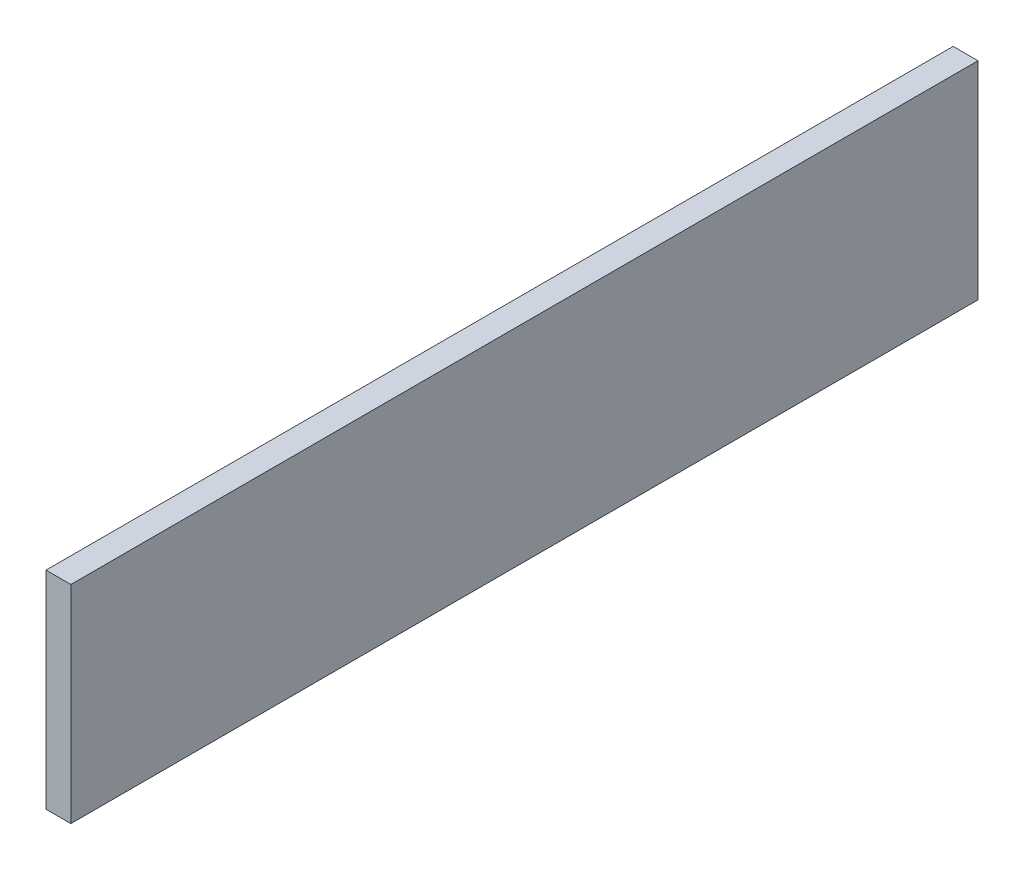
ISO-10303-21;
HEADER;
FILE_DESCRIPTION(('STEP AP214'),'2;1');
FILE_NAME('part.step','',(''),(''),'','','');
FILE_SCHEMA(('AUTOMOTIVE_DESIGN { 1 0 10303 214 1 1 1 1 }'));
ENDSEC;
DATA;
#1=APPLICATION_CONTEXT('core data for automotive mechanical design processes');
#2=APPLICATION_PROTOCOL_DEFINITION('international standard','automotive_design',2000,#1);
#3=PRODUCT_CONTEXT('',#1,'mechanical');
#4=PRODUCT('Part','Part','',(#3));
#5=PRODUCT_RELATED_PRODUCT_CATEGORY('part','',(#4));
#6=PRODUCT_DEFINITION_FORMATION('','',#4);
#7=PRODUCT_DEFINITION_CONTEXT('part definition',#1,'design');
#8=PRODUCT_DEFINITION('design','',#6,#7);
#9=PRODUCT_DEFINITION_SHAPE('','',#8);
#10=(LENGTH_UNIT() NAMED_UNIT(*) SI_UNIT(.MILLI.,.METRE.));
#11=(NAMED_UNIT(*) PLANE_ANGLE_UNIT() SI_UNIT($,.RADIAN.));
#12=(NAMED_UNIT(*) SI_UNIT($,.STERADIAN.) SOLID_ANGLE_UNIT());
#13=UNCERTAINTY_MEASURE_WITH_UNIT(LENGTH_MEASURE(1.E-05),#10,'distance_accuracy_value','');
#14=(GEOMETRIC_REPRESENTATION_CONTEXT(3) GLOBAL_UNCERTAINTY_ASSIGNED_CONTEXT((#13)) GLOBAL_UNIT_ASSIGNED_CONTEXT((#10,
#11,#12)) REPRESENTATION_CONTEXT('',''));
#15=CARTESIAN_POINT('',(0.,0.,0.));
#16=DIRECTION('',(0.,0.,1.));
#17=DIRECTION('',(1.,0.,0.));
#18=AXIS2_PLACEMENT_3D('',#15,#16,#17);
#19=CARTESIAN_POINT('',(3.048,0.,0.));
#20=DIRECTION('',(0.,0.,-1.));
#21=DIRECTION('',(-1.,0.,0.));
#22=AXIS2_PLACEMENT_3D('',#19,#20,#21);
#23=PLANE('',#22);
#24=DIRECTION('',(0.,-1.,0.));
#25=VECTOR('',#24,1.);
#26=CARTESIAN_POINT('',(0.,0.,0.));
#27=LINE('',#26,#25);
#28=CARTESIAN_POINT('',(0.,25.4,0.));
#29=VERTEX_POINT('',#28);
#30=CARTESIAN_POINT('',(0.,0.,0.));
#31=VERTEX_POINT('',#30);
#32=EDGE_CURVE('E96',#29,#31,#27,.T.);
#33=ORIENTED_EDGE('',*,*,#32,.T.);
#34=DIRECTION('',(-1.,0.,0.));
#35=VECTOR('',#34,1.);
#36=CARTESIAN_POINT('',(3.048,0.,0.));
#37=LINE('',#36,#35);
#38=CARTESIAN_POINT('',(3.048,0.,0.));
#39=VERTEX_POINT('',#38);
#40=EDGE_CURVE('E11',#39,#31,#37,.T.);
#41=ORIENTED_EDGE('',*,*,#40,.F.);
#42=DIRECTION('',(0.,-1.,0.));
#43=VECTOR('',#42,1.);
#44=CARTESIAN_POINT('',(3.048,0.,0.));
#45=LINE('',#44,#43);
#46=CARTESIAN_POINT('',(3.048,25.4,0.));
#47=VERTEX_POINT('',#46);
#48=EDGE_CURVE('E84',#47,#39,#45,.T.);
#49=ORIENTED_EDGE('',*,*,#48,.F.);
#50=DIRECTION('',(-1.,0.,0.));
#51=VECTOR('',#50,1.);
#52=CARTESIAN_POINT('',(3.048,25.4,0.));
#53=LINE('',#52,#51);
#54=EDGE_CURVE('E92',#47,#29,#53,.T.);
#55=ORIENTED_EDGE('',*,*,#54,.T.);
#56=EDGE_LOOP('',(#33,#41,#49,#55));
#57=FACE_BOUND('',#56,.T.);
#58=ADVANCED_FACE('F33',(#57),#23,.F.);
#59=CARTESIAN_POINT('',(3.048,0.,0.));
#60=DIRECTION('',(0.,1.,0.));
#61=DIRECTION('',(0.,0.,1.));
#62=AXIS2_PLACEMENT_3D('',#59,#60,#61);
#63=PLANE('',#62);
#64=DIRECTION('',(0.,0.,-1.));
#65=VECTOR('',#64,1.);
#66=CARTESIAN_POINT('',(0.,0.,0.));
#67=LINE('',#66,#65);
#68=CARTESIAN_POINT('',(0.,0.,-111.252));
#69=VERTEX_POINT('',#68);
#70=EDGE_CURVE('E88',#31,#69,#67,.T.);
#71=ORIENTED_EDGE('',*,*,#70,.T.);
#72=DIRECTION('',(-1.,0.,0.));
#73=VECTOR('',#72,1.);
#74=CARTESIAN_POINT('',(3.048,0.,-111.252));
#75=LINE('',#74,#73);
#76=CARTESIAN_POINT('',(3.048,0.,-111.252));
#77=VERTEX_POINT('',#76);
#78=EDGE_CURVE('E41',#77,#69,#75,.T.);
#79=ORIENTED_EDGE('',*,*,#78,.F.);
#80=DIRECTION('',(0.,0.,-1.));
#81=VECTOR('',#80,1.);
#82=CARTESIAN_POINT('',(3.048,0.,0.));
#83=LINE('',#82,#81);
#84=EDGE_CURVE('E79',#39,#77,#83,.T.);
#85=ORIENTED_EDGE('',*,*,#84,.F.);
#86=ORIENTED_EDGE('',*,*,#40,.T.);
#87=EDGE_LOOP('',(#71,#79,#85,#86));
#88=FACE_BOUND('',#87,.T.);
#89=ADVANCED_FACE('F87',(#88),#63,.F.);
#90=CARTESIAN_POINT('',(3.048,0.,-111.252));
#91=DIRECTION('',(0.,0.,1.));
#92=DIRECTION('',(1.,0.,0.));
#93=AXIS2_PLACEMENT_3D('',#90,#91,#92);
#94=PLANE('',#93);
#95=DIRECTION('',(0.,1.,0.));
#96=VECTOR('',#95,1.);
#97=CARTESIAN_POINT('',(0.,0.,-111.252));
#98=LINE('',#97,#96);
#99=CARTESIAN_POINT('',(0.,25.4,-111.252));
#100=VERTEX_POINT('',#99);
#101=EDGE_CURVE('E66',#69,#100,#98,.T.);
#102=ORIENTED_EDGE('',*,*,#101,.T.);
#103=DIRECTION('',(-1.,0.,0.));
#104=VECTOR('',#103,1.);
#105=CARTESIAN_POINT('',(3.048,25.4,-111.252));
#106=LINE('',#105,#104);
#107=CARTESIAN_POINT('',(3.048,25.4,-111.252));
#108=VERTEX_POINT('',#107);
#109=EDGE_CURVE('E89',#108,#100,#106,.T.);
#110=ORIENTED_EDGE('',*,*,#109,.F.);
#111=DIRECTION('',(0.,1.,0.));
#112=VECTOR('',#111,1.);
#113=CARTESIAN_POINT('',(3.048,0.,-111.252));
#114=LINE('',#113,#112);
#115=EDGE_CURVE('E82',#77,#108,#114,.T.);
#116=ORIENTED_EDGE('',*,*,#115,.F.);
#117=ORIENTED_EDGE('',*,*,#78,.T.);
#118=EDGE_LOOP('',(#102,#110,#116,#117));
#119=FACE_BOUND('',#118,.T.);
#120=ADVANCED_FACE('F90',(#119),#94,.F.);
#121=CARTESIAN_POINT('',(3.048,25.4,0.));
#122=DIRECTION('',(0.,-1.,0.));
#123=DIRECTION('',(0.,0.,-1.));
#124=AXIS2_PLACEMENT_3D('',#121,#122,#123);
#125=PLANE('',#124);
#126=DIRECTION('',(0.,0.,1.));
#127=VECTOR('',#126,1.);
#128=CARTESIAN_POINT('',(0.,25.4,0.));
#129=LINE('',#128,#127);
#130=EDGE_CURVE('E72',#100,#29,#129,.T.);
#131=ORIENTED_EDGE('',*,*,#130,.T.);
#132=ORIENTED_EDGE('',*,*,#54,.F.);
#133=DIRECTION('',(0.,0.,1.));
#134=VECTOR('',#133,1.);
#135=CARTESIAN_POINT('',(3.048,25.4,0.));
#136=LINE('',#135,#134);
#137=EDGE_CURVE('E49',#108,#47,#136,.T.);
#138=ORIENTED_EDGE('',*,*,#137,.F.);
#139=ORIENTED_EDGE('',*,*,#109,.T.);
#140=EDGE_LOOP('',(#131,#132,#138,#139));
#141=FACE_BOUND('',#140,.T.);
#142=ADVANCED_FACE('F103',(#141),#125,.F.);
#143=CARTESIAN_POINT('',(3.048,0.,0.));
#144=DIRECTION('',(-1.,0.,0.));
#145=DIRECTION('',(0.,0.,1.));
#146=AXIS2_PLACEMENT_3D('',#143,#144,#145);
#147=PLANE('',#146);
#148=ORIENTED_EDGE('',*,*,#48,.T.);
#149=ORIENTED_EDGE('',*,*,#84,.T.);
#150=ORIENTED_EDGE('',*,*,#115,.T.);
#151=ORIENTED_EDGE('',*,*,#137,.T.);
#152=EDGE_LOOP('',(#148,#149,#150,#151));
#153=FACE_BOUND('',#152,.T.);
#154=ADVANCED_FACE('F80',(#153),#147,.F.);
#155=CARTESIAN_POINT('',(0.,0.,0.));
#156=DIRECTION('',(-1.,0.,0.));
#157=DIRECTION('',(0.,0.,1.));
#158=AXIS2_PLACEMENT_3D('',#155,#156,#157);
#159=PLANE('',#158);
#160=ORIENTED_EDGE('',*,*,#32,.F.);
#161=ORIENTED_EDGE('',*,*,#130,.F.);
#162=ORIENTED_EDGE('',*,*,#101,.F.);
#163=ORIENTED_EDGE('',*,*,#70,.F.);
#164=EDGE_LOOP('',(#160,#161,#162,#163));
#165=FACE_BOUND('',#164,.T.);
#166=ADVANCED_FACE('F106',(#165),#159,.T.);
#167=CLOSED_SHELL('',(#58,#89,#120,#142,#154,#166));
#168=MANIFOLD_SOLID_BREP('B2',#167);
#169=ADVANCED_BREP_SHAPE_REPRESENTATION('',(#18,#168),#14);
#170=SHAPE_DEFINITION_REPRESENTATION(#9,#169);
ENDSEC;
END-ISO-10303-21;
